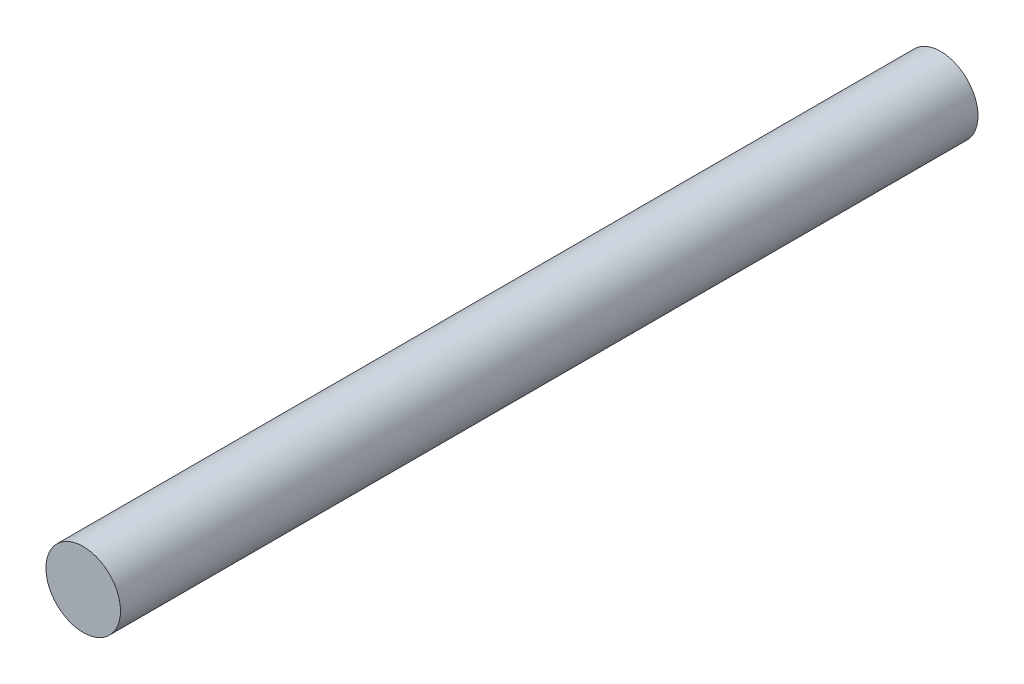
ISO-10303-21;
HEADER;
FILE_DESCRIPTION(('STEP AP214'),'2;1');
FILE_NAME('part.step','',(''),(''),'','','');
FILE_SCHEMA(('AUTOMOTIVE_DESIGN { 1 0 10303 214 1 1 1 1 }'));
ENDSEC;
DATA;
#1=APPLICATION_CONTEXT('core data for automotive mechanical design processes');
#2=APPLICATION_PROTOCOL_DEFINITION('international standard','automotive_design',2000,#1);
#3=PRODUCT_CONTEXT('',#1,'mechanical');
#4=PRODUCT('Part','Part','',(#3));
#5=PRODUCT_RELATED_PRODUCT_CATEGORY('part','',(#4));
#6=PRODUCT_DEFINITION_FORMATION('','',#4);
#7=PRODUCT_DEFINITION_CONTEXT('part definition',#1,'design');
#8=PRODUCT_DEFINITION('design','',#6,#7);
#9=PRODUCT_DEFINITION_SHAPE('','',#8);
#10=(LENGTH_UNIT() NAMED_UNIT(*) SI_UNIT(.MILLI.,.METRE.));
#11=(NAMED_UNIT(*) PLANE_ANGLE_UNIT() SI_UNIT($,.RADIAN.));
#12=(NAMED_UNIT(*) SI_UNIT($,.STERADIAN.) SOLID_ANGLE_UNIT());
#13=UNCERTAINTY_MEASURE_WITH_UNIT(LENGTH_MEASURE(1.E-05),#10,'distance_accuracy_value','');
#14=(GEOMETRIC_REPRESENTATION_CONTEXT(3) GLOBAL_UNCERTAINTY_ASSIGNED_CONTEXT((#13)) GLOBAL_UNIT_ASSIGNED_CONTEXT((#10,
#11,#12)) REPRESENTATION_CONTEXT('',''));
#15=CARTESIAN_POINT('',(0.,0.,0.));
#16=DIRECTION('',(0.,0.,1.));
#17=DIRECTION('',(1.,0.,0.));
#18=AXIS2_PLACEMENT_3D('',#15,#16,#17);
#19=CARTESIAN_POINT('',(3.5527136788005E-12,1.66533453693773E-13,-1168.4));
#20=DIRECTION('',(0.,0.,1.));
#21=DIRECTION('',(1.,0.,0.));
#22=AXIS2_PLACEMENT_3D('',#19,#20,#21);
#23=CYLINDRICAL_SURFACE('',#22,50.8);
#24=CARTESIAN_POINT('',(3.5527136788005E-12,1.66533453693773E-13,-1168.4));
#25=DIRECTION('',(0.,0.,1.));
#26=DIRECTION('',(1.,0.,0.));
#27=AXIS2_PLACEMENT_3D('',#24,#25,#26);
#28=CIRCLE('',#27,50.8);
#29=CARTESIAN_POINT('',(50.8000000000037,1.66244210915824E-13,-1168.4));
#30=VERTEX_POINT('',#29);
#31=EDGE_CURVE('E10',#30,#30,#28,.T.);
#32=ORIENTED_EDGE('',*,*,#31,.T.);
#33=EDGE_LOOP('',(#32));
#34=FACE_BOUND('',#33,.T.);
#35=CARTESIAN_POINT('',(0.,0.,0.));
#36=DIRECTION('',(0.,0.,1.));
#37=DIRECTION('',(1.,0.,0.));
#38=AXIS2_PLACEMENT_3D('',#35,#36,#37);
#39=CIRCLE('',#38,50.8);
#40=CARTESIAN_POINT('',(50.8000000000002,0.,0.));
#41=VERTEX_POINT('',#40);
#42=EDGE_CURVE('E354',#41,#41,#39,.T.);
#43=ORIENTED_EDGE('',*,*,#42,.F.);
#44=EDGE_LOOP('',(#43));
#45=FACE_BOUND('',#44,.T.);
#46=ADVANCED_FACE('F348',(#34,#45),#23,.T.);
#47=CARTESIAN_POINT('',(3.5527136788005E-12,1.66533453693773E-13,-1168.4));
#48=DIRECTION('',(0.,0.,1.));
#49=DIRECTION('',(1.,0.,0.));
#50=AXIS2_PLACEMENT_3D('',#47,#48,#49);
#51=PLANE('',#50);
#52=ORIENTED_EDGE('',*,*,#31,.F.);
#53=EDGE_LOOP('',(#52));
#54=FACE_BOUND('',#53,.T.);
#55=ADVANCED_FACE('F363',(#54),#51,.F.);
#56=CARTESIAN_POINT('',(0.,0.,0.));
#57=DIRECTION('',(0.,0.,1.));
#58=DIRECTION('',(1.,0.,0.));
#59=AXIS2_PLACEMENT_3D('',#56,#57,#58);
#60=PLANE('',#59);
#61=ORIENTED_EDGE('',*,*,#42,.T.);
#62=EDGE_LOOP('',(#61));
#63=FACE_BOUND('',#62,.T.);
#64=ADVANCED_FACE('F360',(#63),#60,.T.);
#65=CLOSED_SHELL('',(#46,#55,#64));
#66=MANIFOLD_SOLID_BREP('B2',#65);
#67=ADVANCED_BREP_SHAPE_REPRESENTATION('',(#18,#66),#14);
#68=SHAPE_DEFINITION_REPRESENTATION(#9,#67);
ENDSEC;
END-ISO-10303-21;
